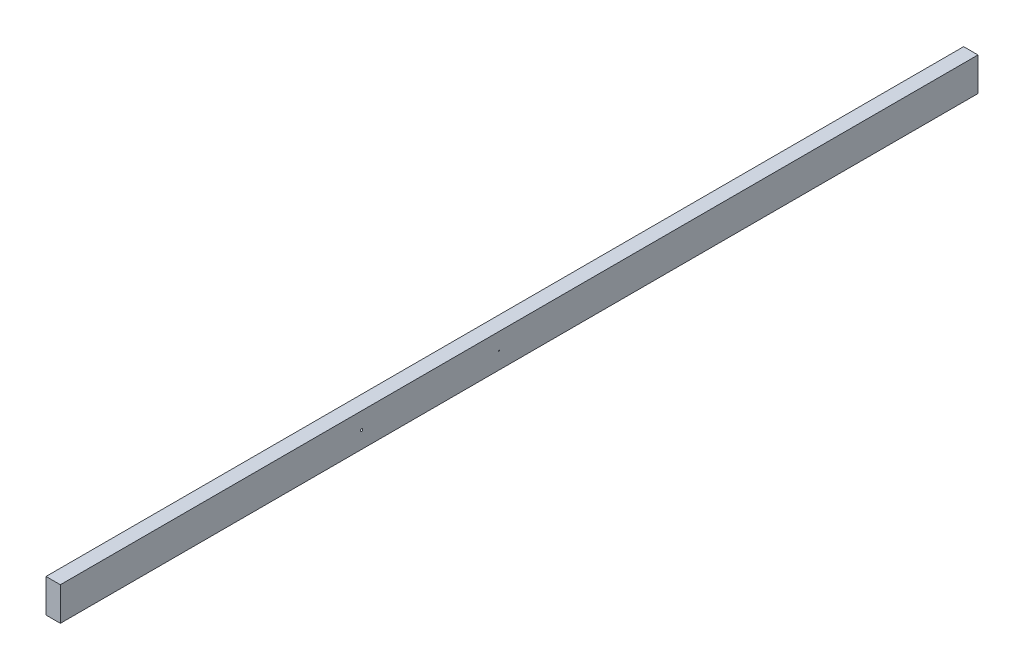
from build123d import *

# Parameters (mm, degrees)
SKETCH1_W               = 38.1
SKETCH1_H               = 88.9
BOSS_EXTRUDE1_DEPTH     = 2438.4
CUT_EXTRUDE1_DEPTH      = 50.8
CUT_EXTRUDE1_DEPTH_BACK = 31.75
SKETCH3_R               = 3.175
SKETCH4_R               = 1.190625
CUT_EXTRUDE4_DEPTH      = 127
SKETCH5_R               = 3.175
CUT_EXTRUDE5_DEPTH      = 2440.102698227


with BuildPart() as part:
    # Sketch1 → Boss-Extrude1 (new body)
    with BuildSketch(Plane.XY):
        Rectangle(SKETCH1_W, SKETCH1_H)
    extrude(amount=-BOSS_EXTRUDE1_DEPTH)

    # Sketch3 → Cut-Extrude1 (cut, two sides: drawn at the far end of the back side and taken through both)
    with BuildSketch(Plane(origin=(554.3677, 0, -554.3677), x_dir=(0, 1, 0), z_dir=(-0.7071067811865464, 0, 0.7071067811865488)).offset(-CUT_EXTRUDE1_DEPTH_BACK)):
        with Locations(Location((0, 810.935088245, 0), (0, 0, 90))):
            Circle(SKETCH3_R)
    extrude(amount=CUT_EXTRUDE1_DEPTH + CUT_EXTRUDE1_DEPTH_BACK, mode=Mode.SUBTRACT)

    # Sketch4 → Cut-Extrude4 (cut)
    with BuildSketch(Plane(origin=(576.818340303, 0, -576.818340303), x_dir=(0.7071067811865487, -1.7661332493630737e-15, 0.7071067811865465), z_dir=(-0.7071067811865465, -1.7661332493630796e-15, 0.7071067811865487))):
        with Locations((-810.935088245, 0)):
            Circle(SKETCH4_R)
    extrude(amount=-CUT_EXTRUDE4_DEPTH, mode=Mode.SUBTRACT)

    # Sketch5 → Cut-Extrude5 (cut, through all)
    with BuildSketch(Plane.ZY.offset(19.05)):
        with Locations((-800.1, 0)):
            Circle(SKETCH5_R)
    extrude(amount=-CUT_EXTRUDE5_DEPTH, mode=Mode.SUBTRACT)


solid = part.part
